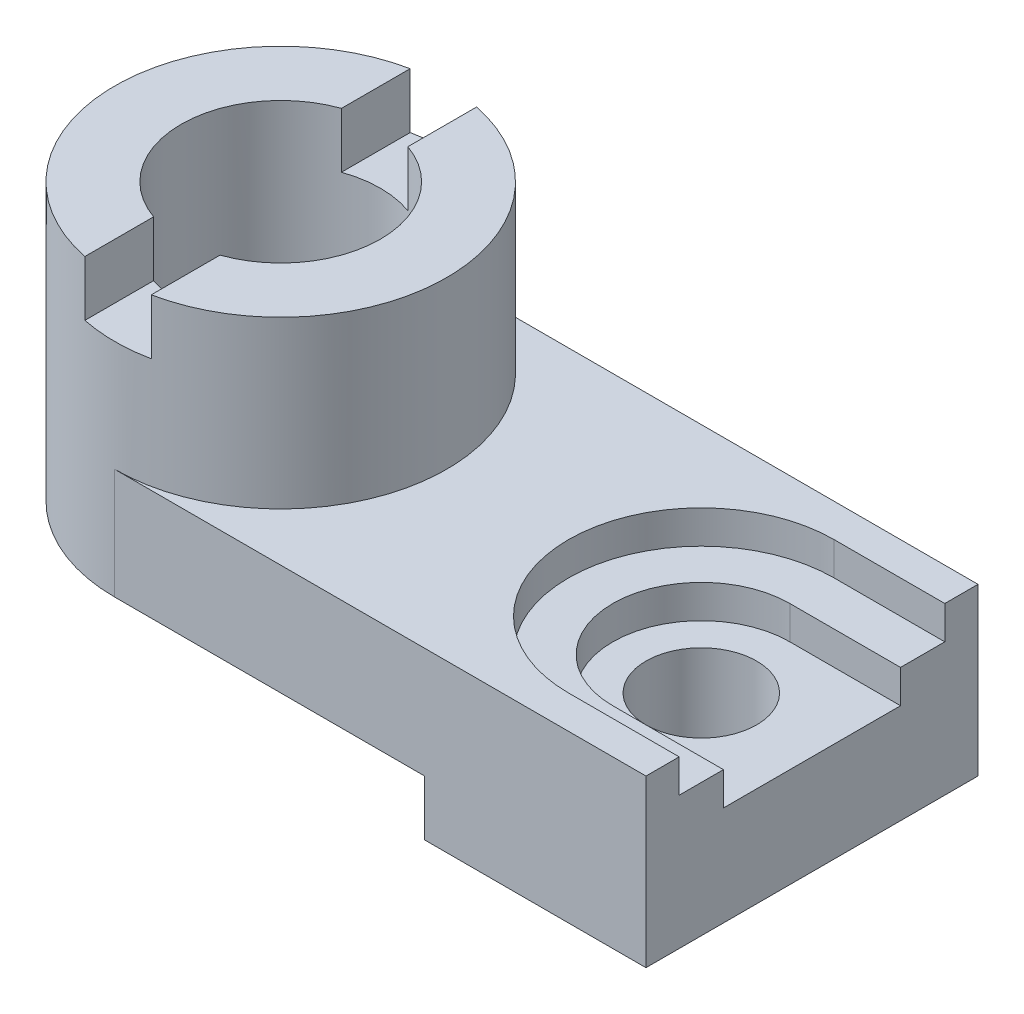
from build123d import *

# Parameters (mm, degrees)
SKETCH_2_W          = 6
SKETCH_2_H          = 5
CUT_EXTRUDE_1_DEPTH = 25
EXTRUDE_START       = -10
SKETCH_4_R          = 5
EXTRUDE_1_DEPTH     = 10
SKETCH_5_W          = 20
SKETCH_5_H          = 30
SKETCH_5_R          = 5
EXTRUDE_2_DEPTH     = 5
CUT_EXTRUDE_2_DEPTH = 3
CUT_EXTRUDE_3_DEPTH = 3


with BuildPart() as part:
    # Sketch 1 → Revolve 1 (revolve)
    with BuildSketch(Plane.XY, mode=Mode.PRIVATE) as revolve_1_sk:
        Polygon((-12, 0), (-15, 0), (-15, 25), (-9, 25), (-9, 5), (-12, 5), align=None)
    revolve(revolve_1_sk.sketch.rotate(Axis((0, 0, 0), (0, 1, 0)), 270), axis=Axis((0, 0, 0), (0, 1, 0)))

    # Sketch 2 → Cut-Extrude 1 (cut, symmetric)
    with BuildSketch(Plane.XY):
        with Locations((0, 22.5)):
            Rectangle(SKETCH_2_W, SKETCH_2_H)
    extrude(amount=CUT_EXTRUDE_1_DEPTH, both=True, mode=Mode.SUBTRACT)

    # Sketch 4 → Extrude 1 (add)
    with BuildSketch(Plane.XZ.offset(EXTRUDE_START)):
        with BuildLine():
            Line((0, -15), (48, -15))
            Line((48, -15), (48, 15))
            Line((48, 15), (0, 15))
            ThreePointArc((0, 15), (15, 0), (0, -15))
        make_face()
        with Locations(Location((38, 0, 0), (0, 0, 90))):
            Circle(SKETCH_4_R, mode=Mode.SUBTRACT)
    extrude(amount=EXTRUDE_1_DEPTH)

    # Sketch 5 → Extrude 2 (add)
    with BuildSketch(Plane(origin=(0, 0, 0), x_dir=(1, 0, 0), z_dir=(0, 1, 0))):
        with Locations((38, 0)):
            Rectangle(SKETCH_5_W, SKETCH_5_H)
        with Locations(Location((38, 0, 0), (0, 0, 270))):
            Circle(SKETCH_5_R, mode=Mode.SUBTRACT)
    extrude(amount=-EXTRUDE_2_DEPTH)

    # Sketch 6 → Cut-Extrude 2 (cut)
    with BuildSketch(Plane(origin=(0, 10, 0), x_dir=(-1, 0, 0), z_dir=(0, 1, 0))):
        with BuildLine():
            Line((-48, -12), (-38, -12))
            ThreePointArc((-38, -12), (-26, 0), (-38, 12))
            Line((-38, 12), (-48, 12))
            Line((-48, 12), (-48, -12))
        make_face()
    extrude(amount=-CUT_EXTRUDE_2_DEPTH, mode=Mode.SUBTRACT)

    # Sketch 7 → Cut-Extrude 3 (cut)
    with BuildSketch(Plane(origin=(0, 7, 0), x_dir=(-1, 0, 0), z_dir=(0, 1, 0))):
        with BuildLine():
            Line((-48, -8), (-38, -8))
            ThreePointArc((-38, -8), (-30, 0), (-38, 8))
            Line((-38, 8), (-48, 8))
            Line((-48, 8), (-48, -8))
        make_face()
    extrude(amount=-CUT_EXTRUDE_3_DEPTH, mode=Mode.SUBTRACT)


solid = part.part
